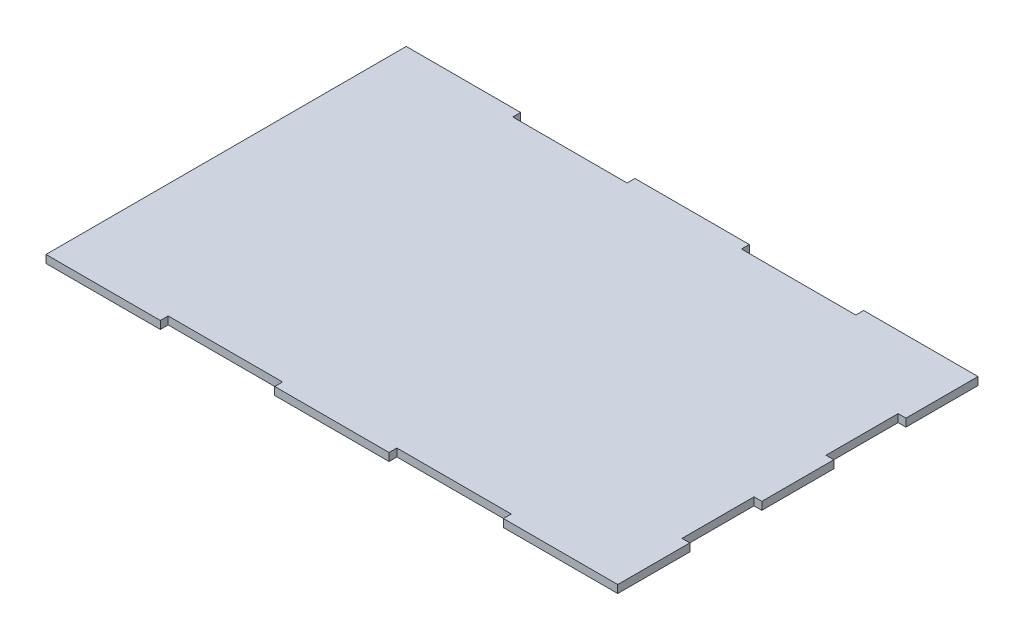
from build123d import *

# Parameters (mm, degrees)
BOSS_EXTRUDE1_DEPTH = 3.175


with BuildPart() as part:
    # Sketch1 → Boss-Extrude1 (new body)
    with BuildSketch(Plane(origin=(0, 3.175, 0), x_dir=(-1, 0, 0), z_dir=(0, 1, 0))):
        Polygon((-46.355, -146.05), (0, -146.05), (0, 0), (-46.355, 0), (-46.355, -3.175), (-92.71, -3.175), (-92.71, 0), (-139.065, 0), (-139.065, -3.175), (-185.42, -3.175), (-185.42, 0), (-231.775, 0), (-231.775, -29.21), (-228.6, -29.21), (-228.6, -58.42), (-231.775, -58.42), (-231.775, -87.63), (-228.6, -87.63), (-228.6, -116.84), (-231.775, -116.84), (-231.775, -146.05), (-185.42, -146.05), (-185.42, -142.875), (-139.065, -142.875), (-139.065, -146.05), (-92.71, -146.05), (-92.71, -142.875), (-46.355, -142.875), align=None)
    extrude(amount=-BOSS_EXTRUDE1_DEPTH)


solid = part.part
